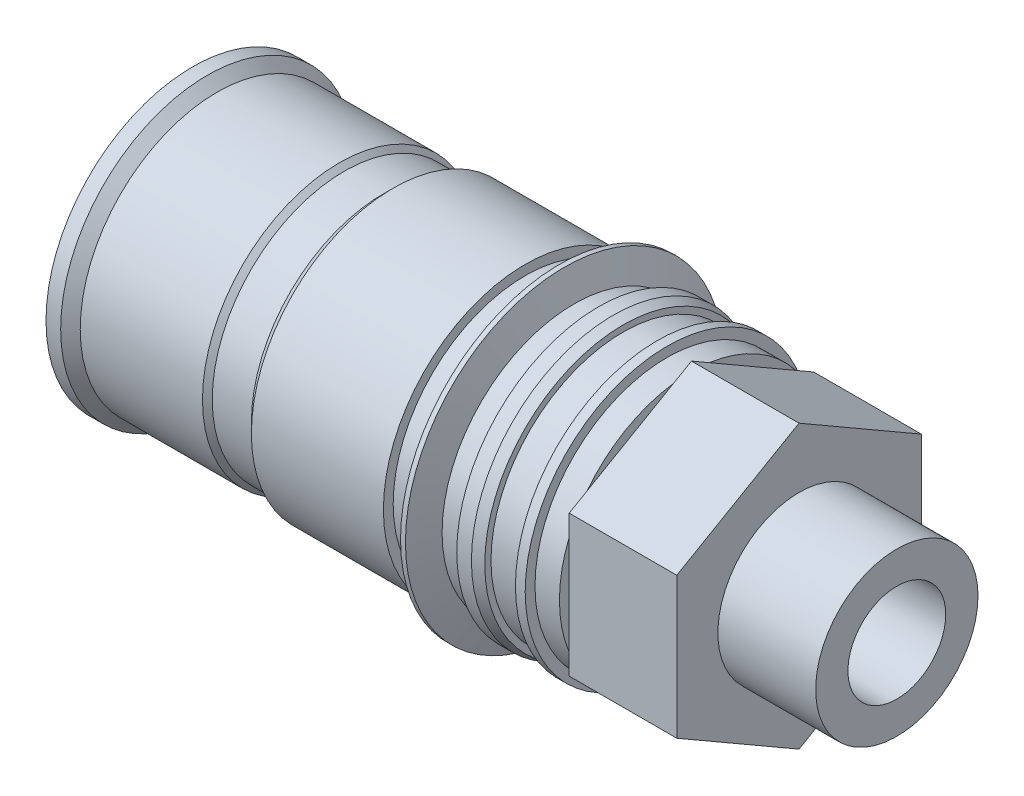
ISO-10303-21;
HEADER;
FILE_DESCRIPTION(('STEP AP214'),'2;1');
FILE_NAME('part.step','',(''),(''),'','','');
FILE_SCHEMA(('AUTOMOTIVE_DESIGN { 1 0 10303 214 1 1 1 1 }'));
ENDSEC;
DATA;
#1=APPLICATION_CONTEXT('core data for automotive mechanical design processes');
#2=APPLICATION_PROTOCOL_DEFINITION('international standard','automotive_design',2000,#1);
#3=PRODUCT_CONTEXT('',#1,'mechanical');
#4=PRODUCT('Part','Part','',(#3));
#5=PRODUCT_RELATED_PRODUCT_CATEGORY('part','',(#4));
#6=PRODUCT_DEFINITION_FORMATION('','',#4);
#7=PRODUCT_DEFINITION_CONTEXT('part definition',#1,'design');
#8=PRODUCT_DEFINITION('design','',#6,#7);
#9=PRODUCT_DEFINITION_SHAPE('','',#8);
#10=(LENGTH_UNIT() NAMED_UNIT(*) SI_UNIT(.MILLI.,.METRE.));
#11=(NAMED_UNIT(*) PLANE_ANGLE_UNIT() SI_UNIT($,.RADIAN.));
#12=(NAMED_UNIT(*) SI_UNIT($,.STERADIAN.) SOLID_ANGLE_UNIT());
#13=UNCERTAINTY_MEASURE_WITH_UNIT(LENGTH_MEASURE(1.E-05),#10,'distance_accuracy_value','');
#14=(GEOMETRIC_REPRESENTATION_CONTEXT(3) GLOBAL_UNCERTAINTY_ASSIGNED_CONTEXT((#13)) GLOBAL_UNIT_ASSIGNED_CONTEXT((#10,
#11,#12)) REPRESENTATION_CONTEXT('',''));
#15=CARTESIAN_POINT('',(0.,0.,0.));
#16=DIRECTION('',(0.,0.,1.));
#17=DIRECTION('',(1.,0.,0.));
#18=AXIS2_PLACEMENT_3D('',#15,#16,#17);
#19=CARTESIAN_POINT('',(102.,27.,0.));
#20=DIRECTION('',(-1.,0.,0.));
#21=DIRECTION('',(0.,0.,1.));
#22=AXIS2_PLACEMENT_3D('',#19,#20,#21);
#23=PLANE('',#22);
#24=DIRECTION('',(0.,0.5,0.866025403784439));
#25=VECTOR('',#24,1.);
#26=CARTESIAN_POINT('',(102.,14.4337567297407,-25.));
#27=LINE('',#26,#25);
#28=CARTESIAN_POINT('',(102.,16.5516155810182,-21.3317608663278));
#29=VERTEX_POINT('',#28);
#30=CARTESIAN_POINT('',(102.,26.7496546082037,-3.66823913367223));
#31=VERTEX_POINT('',#30);
#32=EDGE_CURVE('E42',#29,#31,#27,.T.);
#33=ORIENTED_EDGE('',*,*,#32,.F.);
#34=CARTESIAN_POINT('',(102.,0.,0.));
#35=DIRECTION('',(-1.,0.,0.));
#36=DIRECTION('',(0.,0.,1.));
#37=AXIS2_PLACEMENT_3D('',#34,#35,#36);
#38=CIRCLE('',#37,27.);
#39=EDGE_CURVE('E297',#31,#29,#38,.T.);
#40=ORIENTED_EDGE('',*,*,#39,.F.);
#41=EDGE_LOOP('',(#33,#40));
#42=FACE_BOUND('',#41,.T.);
#43=ADVANCED_FACE('F33',(#42),#23,.F.);
#44=DIRECTION('',(0.,1.,0.));
#45=VECTOR('',#44,1.);
#46=CARTESIAN_POINT('',(102.,-14.4337567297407,-25.));
#47=LINE('',#46,#45);
#48=CARTESIAN_POINT('',(102.,-10.1980390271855,-25.));
#49=VERTEX_POINT('',#48);
#50=CARTESIAN_POINT('',(102.,10.1980390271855,-25.));
#51=VERTEX_POINT('',#50);
#52=EDGE_CURVE('E243',#49,#51,#47,.T.);
#53=ORIENTED_EDGE('',*,*,#52,.F.);
#54=EDGE_CURVE('E291',#51,#49,#38,.T.);
#55=ORIENTED_EDGE('',*,*,#54,.F.);
#56=EDGE_LOOP('',(#53,#55));
#57=FACE_BOUND('',#56,.T.);
#58=ADVANCED_FACE('F324',(#57),#23,.F.);
#59=DIRECTION('',(0.,0.5,-0.866025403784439));
#60=VECTOR('',#59,1.);
#61=CARTESIAN_POINT('',(102.,-28.8675134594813,0.));
#62=LINE('',#61,#60);
#63=CARTESIAN_POINT('',(102.,-26.7496546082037,-3.66823913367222));
#64=VERTEX_POINT('',#63);
#65=CARTESIAN_POINT('',(102.,-16.5516155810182,-21.3317608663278));
#66=VERTEX_POINT('',#65);
#67=EDGE_CURVE('E245',#64,#66,#62,.T.);
#68=ORIENTED_EDGE('',*,*,#67,.F.);
#69=EDGE_CURVE('E285',#66,#64,#38,.T.);
#70=ORIENTED_EDGE('',*,*,#69,.F.);
#71=EDGE_LOOP('',(#68,#70));
#72=FACE_BOUND('',#71,.T.);
#73=ADVANCED_FACE('F331',(#72),#23,.F.);
#74=DIRECTION('',(0.,-0.5,-0.866025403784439));
#75=VECTOR('',#74,1.);
#76=CARTESIAN_POINT('',(102.,-14.4337567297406,25.));
#77=LINE('',#76,#75);
#78=CARTESIAN_POINT('',(102.,-16.5516155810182,21.3317608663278));
#79=VERTEX_POINT('',#78);
#80=CARTESIAN_POINT('',(102.,-26.7496546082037,3.66823913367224));
#81=VERTEX_POINT('',#80);
#82=EDGE_CURVE('E56',#79,#81,#77,.T.);
#83=ORIENTED_EDGE('',*,*,#82,.F.);
#84=EDGE_CURVE('E282',#81,#79,#38,.T.);
#85=ORIENTED_EDGE('',*,*,#84,.F.);
#86=EDGE_LOOP('',(#83,#85));
#87=FACE_BOUND('',#86,.T.);
#88=ADVANCED_FACE('F343',(#87),#23,.F.);
#89=DIRECTION('',(0.,-1.,0.));
#90=VECTOR('',#89,1.);
#91=CARTESIAN_POINT('',(102.,14.4337567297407,25.));
#92=LINE('',#91,#90);
#93=CARTESIAN_POINT('',(102.,10.1980390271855,25.));
#94=VERTEX_POINT('',#93);
#95=CARTESIAN_POINT('',(102.,-10.1980390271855,25.));
#96=VERTEX_POINT('',#95);
#97=EDGE_CURVE('E229',#94,#96,#92,.T.);
#98=ORIENTED_EDGE('',*,*,#97,.F.);
#99=EDGE_CURVE('E49',#96,#94,#38,.T.);
#100=ORIENTED_EDGE('',*,*,#99,.F.);
#101=EDGE_LOOP('',(#98,#100));
#102=FACE_BOUND('',#101,.T.);
#103=ADVANCED_FACE('F336',(#102),#23,.F.);
#104=DIRECTION('',(0.,-0.5,0.866025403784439));
#105=VECTOR('',#104,1.);
#106=CARTESIAN_POINT('',(102.,28.8675134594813,0.));
#107=LINE('',#106,#105);
#108=CARTESIAN_POINT('',(102.,26.7496546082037,3.66823913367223));
#109=VERTEX_POINT('',#108);
#110=CARTESIAN_POINT('',(102.,16.5516155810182,21.3317608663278));
#111=VERTEX_POINT('',#110);
#112=EDGE_CURVE('E225',#109,#111,#107,.T.);
#113=ORIENTED_EDGE('',*,*,#112,.F.);
#114=EDGE_CURVE('E161',#111,#109,#38,.T.);
#115=ORIENTED_EDGE('',*,*,#114,.F.);
#116=EDGE_LOOP('',(#113,#115));
#117=FACE_BOUND('',#116,.T.);
#118=ADVANCED_FACE('F327',(#117),#23,.F.);
#119=CARTESIAN_POINT('',(0.,0.,0.));
#120=DIRECTION('',(1.,0.,0.));
#121=DIRECTION('',(0.,0.,-1.));
#122=AXIS2_PLACEMENT_3D('',#119,#120,#121);
#123=PLANE('',#122);
#124=CARTESIAN_POINT('',(0.,0.,0.));
#125=DIRECTION('',(1.,0.,0.));
#126=DIRECTION('',(0.,0.,-1.));
#127=AXIS2_PLACEMENT_3D('',#124,#125,#126);
#128=CIRCLE('',#127,10.);
#129=CARTESIAN_POINT('',(0.,0.,-10.));
#130=VERTEX_POINT('',#129);
#131=EDGE_CURVE('E398',#130,#130,#128,.T.);
#132=ORIENTED_EDGE('',*,*,#131,.T.);
#133=EDGE_LOOP('',(#132));
#134=FACE_BOUND('',#133,.T.);
#135=CARTESIAN_POINT('',(0.,0.,0.));
#136=DIRECTION('',(-1.,0.,0.));
#137=DIRECTION('',(0.,0.,1.));
#138=AXIS2_PLACEMENT_3D('',#135,#136,#137);
#139=CIRCLE('',#138,30.);
#140=CARTESIAN_POINT('',(0.,0.,30.));
#141=VERTEX_POINT('',#140);
#142=EDGE_CURVE('E37',#141,#141,#139,.T.);
#143=ORIENTED_EDGE('',*,*,#142,.T.);
#144=EDGE_LOOP('',(#143));
#145=FACE_BOUND('',#144,.T.);
#146=ADVANCED_FACE('F35',(#134,#145),#123,.F.);
#147=CARTESIAN_POINT('',(0.,0.,0.));
#148=DIRECTION('',(-1.,0.,0.));
#149=DIRECTION('',(0.,0.,1.));
#150=AXIS2_PLACEMENT_3D('',#147,#148,#149);
#151=CYLINDRICAL_SURFACE('',#150,30.);
#152=ORIENTED_EDGE('',*,*,#142,.F.);
#153=EDGE_LOOP('',(#152));
#154=FACE_BOUND('',#153,.T.);
#155=CARTESIAN_POINT('',(3.,0.,0.));
#156=DIRECTION('',(-1.,0.,0.));
#157=DIRECTION('',(0.,0.,1.));
#158=AXIS2_PLACEMENT_3D('',#155,#156,#157);
#159=CIRCLE('',#158,30.);
#160=CARTESIAN_POINT('',(3.,0.,30.));
#161=VERTEX_POINT('',#160);
#162=EDGE_CURVE('E220',#161,#161,#159,.T.);
#163=ORIENTED_EDGE('',*,*,#162,.T.);
#164=EDGE_LOOP('',(#163));
#165=FACE_BOUND('',#164,.T.);
#166=ADVANCED_FACE('F341',(#154,#165),#151,.T.);
#167=CARTESIAN_POINT('',(5.,0.,0.));
#168=DIRECTION('',(-1.,0.,0.));
#169=DIRECTION('',(0.,0.,1.));
#170=AXIS2_PLACEMENT_3D('',#167,#168,#169);
#171=CONICAL_SURFACE('',#170,28.,0.78539816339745);
#172=ORIENTED_EDGE('',*,*,#162,.F.);
#173=EDGE_LOOP('',(#172));
#174=FACE_BOUND('',#173,.T.);
#175=CARTESIAN_POINT('',(5.,0.,0.));
#176=DIRECTION('',(-1.,0.,0.));
#177=DIRECTION('',(0.,0.,1.));
#178=AXIS2_PLACEMENT_3D('',#175,#176,#177);
#179=CIRCLE('',#178,28.);
#180=CARTESIAN_POINT('',(5.,0.,28.));
#181=VERTEX_POINT('',#180);
#182=EDGE_CURVE('E218',#181,#181,#179,.T.);
#183=ORIENTED_EDGE('',*,*,#182,.T.);
#184=EDGE_LOOP('',(#183));
#185=FACE_BOUND('',#184,.T.);
#186=ADVANCED_FACE('F440',(#174,#185),#171,.T.);
#187=CARTESIAN_POINT('',(0.,0.,0.));
#188=DIRECTION('',(-1.,0.,0.));
#189=DIRECTION('',(0.,0.,1.));
#190=AXIS2_PLACEMENT_3D('',#187,#188,#189);
#191=CYLINDRICAL_SURFACE('',#190,28.);
#192=ORIENTED_EDGE('',*,*,#182,.F.);
#193=EDGE_LOOP('',(#192));
#194=FACE_BOUND('',#193,.T.);
#195=CARTESIAN_POINT('',(30.,0.,0.));
#196=DIRECTION('',(-1.,0.,0.));
#197=DIRECTION('',(0.,0.,1.));
#198=AXIS2_PLACEMENT_3D('',#195,#196,#197);
#199=CIRCLE('',#198,28.);
#200=CARTESIAN_POINT('',(30.,0.,28.));
#201=VERTEX_POINT('',#200);
#202=EDGE_CURVE('E215',#201,#201,#199,.T.);
#203=ORIENTED_EDGE('',*,*,#202,.T.);
#204=EDGE_LOOP('',(#203));
#205=FACE_BOUND('',#204,.T.);
#206=ADVANCED_FACE('F446',(#194,#205),#191,.T.);
#207=CARTESIAN_POINT('',(31.,0.,0.));
#208=DIRECTION('',(-1.,0.,0.));
#209=DIRECTION('',(0.,0.,1.));
#210=AXIS2_PLACEMENT_3D('',#207,#208,#209);
#211=CONICAL_SURFACE('',#210,27.,0.78539816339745);
#212=ORIENTED_EDGE('',*,*,#202,.F.);
#213=EDGE_LOOP('',(#212));
#214=FACE_BOUND('',#213,.T.);
#215=CARTESIAN_POINT('',(31.,0.,0.));
#216=DIRECTION('',(-1.,0.,0.));
#217=DIRECTION('',(0.,0.,1.));
#218=AXIS2_PLACEMENT_3D('',#215,#216,#217);
#219=CIRCLE('',#218,27.);
#220=CARTESIAN_POINT('',(31.,0.,27.));
#221=VERTEX_POINT('',#220);
#222=EDGE_CURVE('E212',#221,#221,#219,.T.);
#223=ORIENTED_EDGE('',*,*,#222,.T.);
#224=EDGE_LOOP('',(#223));
#225=FACE_BOUND('',#224,.T.);
#226=ADVANCED_FACE('F454',(#214,#225),#211,.T.);
#227=CARTESIAN_POINT('',(0.,0.,0.));
#228=DIRECTION('',(-1.,0.,0.));
#229=DIRECTION('',(0.,0.,1.));
#230=AXIS2_PLACEMENT_3D('',#227,#228,#229);
#231=CYLINDRICAL_SURFACE('',#230,27.);
#232=ORIENTED_EDGE('',*,*,#222,.F.);
#233=EDGE_LOOP('',(#232));
#234=FACE_BOUND('',#233,.T.);
#235=CARTESIAN_POINT('',(39.,0.,0.));
#236=DIRECTION('',(-1.,0.,0.));
#237=DIRECTION('',(0.,0.,1.));
#238=AXIS2_PLACEMENT_3D('',#235,#236,#237);
#239=CIRCLE('',#238,27.);
#240=CARTESIAN_POINT('',(39.,0.,27.));
#241=VERTEX_POINT('',#240);
#242=EDGE_CURVE('E209',#241,#241,#239,.T.);
#243=ORIENTED_EDGE('',*,*,#242,.T.);
#244=EDGE_LOOP('',(#243));
#245=FACE_BOUND('',#244,.T.);
#246=ADVANCED_FACE('F462',(#234,#245),#231,.T.);
#247=CARTESIAN_POINT('',(41.,0.,0.));
#248=DIRECTION('',(1.,0.,0.));
#249=DIRECTION('',(0.,0.,-1.));
#250=AXIS2_PLACEMENT_3D('',#247,#248,#249);
#251=CONICAL_SURFACE('',#250,29.,0.785398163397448);
#252=ORIENTED_EDGE('',*,*,#242,.F.);
#253=EDGE_LOOP('',(#252));
#254=FACE_BOUND('',#253,.T.);
#255=CARTESIAN_POINT('',(41.,0.,0.));
#256=DIRECTION('',(-1.,0.,0.));
#257=DIRECTION('',(0.,0.,1.));
#258=AXIS2_PLACEMENT_3D('',#255,#256,#257);
#259=CIRCLE('',#258,29.);
#260=CARTESIAN_POINT('',(41.,0.,29.));
#261=VERTEX_POINT('',#260);
#262=EDGE_CURVE('E206',#261,#261,#259,.T.);
#263=ORIENTED_EDGE('',*,*,#262,.T.);
#264=EDGE_LOOP('',(#263));
#265=FACE_BOUND('',#264,.T.);
#266=ADVANCED_FACE('F470',(#254,#265),#251,.T.);
#267=CARTESIAN_POINT('',(0.,0.,0.));
#268=DIRECTION('',(-1.,0.,0.));
#269=DIRECTION('',(0.,0.,1.));
#270=AXIS2_PLACEMENT_3D('',#267,#268,#269);
#271=CYLINDRICAL_SURFACE('',#270,29.);
#272=ORIENTED_EDGE('',*,*,#262,.F.);
#273=EDGE_LOOP('',(#272));
#274=FACE_BOUND('',#273,.T.);
#275=CARTESIAN_POINT('',(68.,0.,0.));
#276=DIRECTION('',(-1.,0.,0.));
#277=DIRECTION('',(0.,0.,1.));
#278=AXIS2_PLACEMENT_3D('',#275,#276,#277);
#279=CIRCLE('',#278,29.);
#280=CARTESIAN_POINT('',(68.,0.,29.));
#281=VERTEX_POINT('',#280);
#282=EDGE_CURVE('E203',#281,#281,#279,.T.);
#283=ORIENTED_EDGE('',*,*,#282,.T.);
#284=EDGE_LOOP('',(#283));
#285=FACE_BOUND('',#284,.T.);
#286=ADVANCED_FACE('F478',(#274,#285),#271,.T.);
#287=CARTESIAN_POINT('',(68.,29.,0.));
#288=DIRECTION('',(-1.,0.,0.));
#289=DIRECTION('',(0.,0.,1.));
#290=AXIS2_PLACEMENT_3D('',#287,#288,#289);
#291=PLANE('',#290);
#292=ORIENTED_EDGE('',*,*,#282,.F.);
#293=EDGE_LOOP('',(#292));
#294=FACE_BOUND('',#293,.T.);
#295=CARTESIAN_POINT('',(68.,0.,0.));
#296=DIRECTION('',(-1.,0.,0.));
#297=DIRECTION('',(0.,0.,1.));
#298=AXIS2_PLACEMENT_3D('',#295,#296,#297);
#299=CIRCLE('',#298,27.);
#300=CARTESIAN_POINT('',(68.,0.,27.));
#301=VERTEX_POINT('',#300);
#302=EDGE_CURVE('E200',#301,#301,#299,.T.);
#303=ORIENTED_EDGE('',*,*,#302,.T.);
#304=EDGE_LOOP('',(#303));
#305=FACE_BOUND('',#304,.T.);
#306=ADVANCED_FACE('F486',(#294,#305),#291,.F.);
#307=CARTESIAN_POINT('',(0.,0.,0.));
#308=DIRECTION('',(-1.,0.,0.));
#309=DIRECTION('',(0.,0.,1.));
#310=AXIS2_PLACEMENT_3D('',#307,#308,#309);
#311=CYLINDRICAL_SURFACE('',#310,27.);
#312=ORIENTED_EDGE('',*,*,#302,.F.);
#313=EDGE_LOOP('',(#312));
#314=FACE_BOUND('',#313,.T.);
#315=CARTESIAN_POINT('',(73.,0.,0.));
#316=DIRECTION('',(-1.,0.,0.));
#317=DIRECTION('',(0.,0.,1.));
#318=AXIS2_PLACEMENT_3D('',#315,#316,#317);
#319=CIRCLE('',#318,27.);
#320=CARTESIAN_POINT('',(73.,0.,27.));
#321=VERTEX_POINT('',#320);
#322=EDGE_CURVE('E197',#321,#321,#319,.T.);
#323=ORIENTED_EDGE('',*,*,#322,.T.);
#324=EDGE_LOOP('',(#323));
#325=FACE_BOUND('',#324,.T.);
#326=ADVANCED_FACE('F494',(#314,#325),#311,.T.);
#327=CARTESIAN_POINT('',(75.,0.,0.));
#328=DIRECTION('',(1.,0.,0.));
#329=DIRECTION('',(0.,0.,-1.));
#330=AXIS2_PLACEMENT_3D('',#327,#328,#329);
#331=CONICAL_SURFACE('',#330,32.4949548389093,1.22173047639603);
#332=ORIENTED_EDGE('',*,*,#322,.F.);
#333=EDGE_LOOP('',(#332));
#334=FACE_BOUND('',#333,.T.);
#335=CARTESIAN_POINT('',(75.,0.,0.));
#336=DIRECTION('',(-1.,0.,0.));
#337=DIRECTION('',(0.,0.,1.));
#338=AXIS2_PLACEMENT_3D('',#335,#336,#337);
#339=CIRCLE('',#338,32.4949548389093);
#340=CARTESIAN_POINT('',(75.,0.,32.4949548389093));
#341=VERTEX_POINT('',#340);
#342=EDGE_CURVE('E194',#341,#341,#339,.T.);
#343=ORIENTED_EDGE('',*,*,#342,.T.);
#344=EDGE_LOOP('',(#343));
#345=FACE_BOUND('',#344,.T.);
#346=ADVANCED_FACE('F502',(#334,#345),#331,.T.);
#347=CARTESIAN_POINT('',(0.,0.,0.));
#348=DIRECTION('',(-1.,0.,0.));
#349=DIRECTION('',(0.,0.,1.));
#350=AXIS2_PLACEMENT_3D('',#347,#348,#349);
#351=CYLINDRICAL_SURFACE('',#350,32.4949548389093);
#352=ORIENTED_EDGE('',*,*,#342,.F.);
#353=EDGE_LOOP('',(#352));
#354=FACE_BOUND('',#353,.T.);
#355=CARTESIAN_POINT('',(76.,0.,0.));
#356=DIRECTION('',(-1.,0.,0.));
#357=DIRECTION('',(0.,0.,1.));
#358=AXIS2_PLACEMENT_3D('',#355,#356,#357);
#359=CIRCLE('',#358,32.4949548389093);
#360=CARTESIAN_POINT('',(76.,0.,32.4949548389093));
#361=VERTEX_POINT('',#360);
#362=EDGE_CURVE('E191',#361,#361,#359,.T.);
#363=ORIENTED_EDGE('',*,*,#362,.T.);
#364=EDGE_LOOP('',(#363));
#365=FACE_BOUND('',#364,.T.);
#366=ADVANCED_FACE('F510',(#354,#365),#351,.T.);
#367=CARTESIAN_POINT('',(78.,0.,0.));
#368=DIRECTION('',(-1.,0.,0.));
#369=DIRECTION('',(0.,0.,1.));
#370=AXIS2_PLACEMENT_3D('',#367,#368,#369);
#371=CONICAL_SURFACE('',#370,27.,1.22173047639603);
#372=ORIENTED_EDGE('',*,*,#362,.F.);
#373=EDGE_LOOP('',(#372));
#374=FACE_BOUND('',#373,.T.);
#375=CARTESIAN_POINT('',(78.,0.,0.));
#376=DIRECTION('',(-1.,0.,0.));
#377=DIRECTION('',(0.,0.,1.));
#378=AXIS2_PLACEMENT_3D('',#375,#376,#377);
#379=CIRCLE('',#378,27.);
#380=CARTESIAN_POINT('',(78.,0.,27.));
#381=VERTEX_POINT('',#380);
#382=EDGE_CURVE('E188',#381,#381,#379,.T.);
#383=ORIENTED_EDGE('',*,*,#382,.T.);
#384=EDGE_LOOP('',(#383));
#385=FACE_BOUND('',#384,.T.);
#386=ADVANCED_FACE('F518',(#374,#385),#371,.T.);
#387=CARTESIAN_POINT('',(0.,0.,0.));
#388=DIRECTION('',(-1.,0.,0.));
#389=DIRECTION('',(0.,0.,1.));
#390=AXIS2_PLACEMENT_3D('',#387,#388,#389);
#391=CYLINDRICAL_SURFACE('',#390,27.);
#392=ORIENTED_EDGE('',*,*,#382,.F.);
#393=EDGE_LOOP('',(#392));
#394=FACE_BOUND('',#393,.T.);
#395=CARTESIAN_POINT('',(83.,0.,0.));
#396=DIRECTION('',(-1.,0.,0.));
#397=DIRECTION('',(0.,0.,1.));
#398=AXIS2_PLACEMENT_3D('',#395,#396,#397);
#399=CIRCLE('',#398,27.);
#400=CARTESIAN_POINT('',(83.,0.,27.));
#401=VERTEX_POINT('',#400);
#402=EDGE_CURVE('E185',#401,#401,#399,.T.);
#403=ORIENTED_EDGE('',*,*,#402,.T.);
#404=EDGE_LOOP('',(#403));
#405=FACE_BOUND('',#404,.T.);
#406=ADVANCED_FACE('F526',(#394,#405),#391,.T.);
#407=CARTESIAN_POINT('',(83.,27.,0.));
#408=DIRECTION('',(1.,0.,0.));
#409=DIRECTION('',(0.,0.,-1.));
#410=AXIS2_PLACEMENT_3D('',#407,#408,#409);
#411=PLANE('',#410);
#412=ORIENTED_EDGE('',*,*,#402,.F.);
#413=EDGE_LOOP('',(#412));
#414=FACE_BOUND('',#413,.T.);
#415=CARTESIAN_POINT('',(83.,0.,0.));
#416=DIRECTION('',(-1.,0.,0.));
#417=DIRECTION('',(0.,0.,1.));
#418=AXIS2_PLACEMENT_3D('',#415,#416,#417);
#419=CIRCLE('',#418,29.);
#420=CARTESIAN_POINT('',(83.,0.,29.));
#421=VERTEX_POINT('',#420);
#422=EDGE_CURVE('E182',#421,#421,#419,.T.);
#423=ORIENTED_EDGE('',*,*,#422,.T.);
#424=EDGE_LOOP('',(#423));
#425=FACE_BOUND('',#424,.T.);
#426=ADVANCED_FACE('F534',(#414,#425),#411,.F.);
#427=CARTESIAN_POINT('',(0.,0.,0.));
#428=DIRECTION('',(-1.,0.,0.));
#429=DIRECTION('',(0.,0.,1.));
#430=AXIS2_PLACEMENT_3D('',#427,#428,#429);
#431=CYLINDRICAL_SURFACE('',#430,29.);
#432=ORIENTED_EDGE('',*,*,#422,.F.);
#433=EDGE_LOOP('',(#432));
#434=FACE_BOUND('',#433,.T.);
#435=CARTESIAN_POINT('',(86.,0.,0.));
#436=DIRECTION('',(-1.,0.,0.));
#437=DIRECTION('',(0.,0.,1.));
#438=AXIS2_PLACEMENT_3D('',#435,#436,#437);
#439=CIRCLE('',#438,29.);
#440=CARTESIAN_POINT('',(86.,0.,29.));
#441=VERTEX_POINT('',#440);
#442=EDGE_CURVE('E179',#441,#441,#439,.T.);
#443=ORIENTED_EDGE('',*,*,#442,.T.);
#444=EDGE_LOOP('',(#443));
#445=FACE_BOUND('',#444,.T.);
#446=ADVANCED_FACE('F542',(#434,#445),#431,.T.);
#447=CARTESIAN_POINT('',(88.,0.,0.));
#448=DIRECTION('',(-1.,0.,0.));
#449=DIRECTION('',(0.,0.,1.));
#450=AXIS2_PLACEMENT_3D('',#447,#448,#449);
#451=CONICAL_SURFACE('',#450,28.2720595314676,0.349065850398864);
#452=ORIENTED_EDGE('',*,*,#442,.F.);
#453=EDGE_LOOP('',(#452));
#454=FACE_BOUND('',#453,.T.);
#455=CARTESIAN_POINT('',(88.,0.,0.));
#456=DIRECTION('',(-1.,0.,0.));
#457=DIRECTION('',(0.,0.,1.));
#458=AXIS2_PLACEMENT_3D('',#455,#456,#457);
#459=CIRCLE('',#458,28.2720595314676);
#460=CARTESIAN_POINT('',(88.,0.,28.2720595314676));
#461=VERTEX_POINT('',#460);
#462=EDGE_CURVE('E176',#461,#461,#459,.T.);
#463=ORIENTED_EDGE('',*,*,#462,.T.);
#464=EDGE_LOOP('',(#463));
#465=FACE_BOUND('',#464,.T.);
#466=ADVANCED_FACE('F550',(#454,#465),#451,.T.);
#467=CARTESIAN_POINT('',(88.0000000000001,28.2720595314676,0.));
#468=DIRECTION('',(-1.,0.,0.));
#469=DIRECTION('',(0.,0.,1.));
#470=AXIS2_PLACEMENT_3D('',#467,#468,#469);
#471=PLANE('',#470);
#472=ORIENTED_EDGE('',*,*,#462,.F.);
#473=EDGE_LOOP('',(#472));
#474=FACE_BOUND('',#473,.T.);
#475=CARTESIAN_POINT('',(88.0000000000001,0.,0.));
#476=DIRECTION('',(-1.,0.,0.));
#477=DIRECTION('',(0.,0.,1.));
#478=AXIS2_PLACEMENT_3D('',#475,#476,#477);
#479=CIRCLE('',#478,27.);
#480=CARTESIAN_POINT('',(88.0000000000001,0.,27.));
#481=VERTEX_POINT('',#480);
#482=EDGE_CURVE('E173',#481,#481,#479,.T.);
#483=ORIENTED_EDGE('',*,*,#482,.T.);
#484=EDGE_LOOP('',(#483));
#485=FACE_BOUND('',#484,.T.);
#486=ADVANCED_FACE('F558',(#474,#485),#471,.F.);
#487=CARTESIAN_POINT('',(0.,0.,0.));
#488=DIRECTION('',(-1.,0.,0.));
#489=DIRECTION('',(0.,0.,1.));
#490=AXIS2_PLACEMENT_3D('',#487,#488,#489);
#491=CYLINDRICAL_SURFACE('',#490,27.);
#492=ORIENTED_EDGE('',*,*,#482,.F.);
#493=EDGE_LOOP('',(#492));
#494=FACE_BOUND('',#493,.T.);
#495=CARTESIAN_POINT('',(95.,0.,0.));
#496=DIRECTION('',(-1.,0.,0.));
#497=DIRECTION('',(0.,0.,1.));
#498=AXIS2_PLACEMENT_3D('',#495,#496,#497);
#499=CIRCLE('',#498,27.);
#500=CARTESIAN_POINT('',(95.,0.,27.));
#501=VERTEX_POINT('',#500);
#502=EDGE_CURVE('E170',#501,#501,#499,.T.);
#503=ORIENTED_EDGE('',*,*,#502,.T.);
#504=EDGE_LOOP('',(#503));
#505=FACE_BOUND('',#504,.T.);
#506=ADVANCED_FACE('F566',(#494,#505),#491,.T.);
#507=CARTESIAN_POINT('',(95.,27.,0.));
#508=DIRECTION('',(1.,0.,0.));
#509=DIRECTION('',(0.,0.,-1.));
#510=AXIS2_PLACEMENT_3D('',#507,#508,#509);
#511=PLANE('',#510);
#512=ORIENTED_EDGE('',*,*,#502,.F.);
#513=EDGE_LOOP('',(#512));
#514=FACE_BOUND('',#513,.T.);
#515=CARTESIAN_POINT('',(95.,0.,0.));
#516=DIRECTION('',(-1.,0.,0.));
#517=DIRECTION('',(0.,0.,1.));
#518=AXIS2_PLACEMENT_3D('',#515,#516,#517);
#519=CIRCLE('',#518,29.);
#520=CARTESIAN_POINT('',(95.,0.,29.));
#521=VERTEX_POINT('',#520);
#522=EDGE_CURVE('E167',#521,#521,#519,.T.);
#523=ORIENTED_EDGE('',*,*,#522,.T.);
#524=EDGE_LOOP('',(#523));
#525=FACE_BOUND('',#524,.T.);
#526=ADVANCED_FACE('F574',(#514,#525),#511,.F.);
#527=CARTESIAN_POINT('',(0.,0.,0.));
#528=DIRECTION('',(-1.,0.,0.));
#529=DIRECTION('',(0.,0.,1.));
#530=AXIS2_PLACEMENT_3D('',#527,#528,#529);
#531=CYLINDRICAL_SURFACE('',#530,29.);
#532=ORIENTED_EDGE('',*,*,#522,.F.);
#533=EDGE_LOOP('',(#532));
#534=FACE_BOUND('',#533,.T.);
#535=CARTESIAN_POINT('',(97.,0.,0.));
#536=DIRECTION('',(-1.,0.,0.));
#537=DIRECTION('',(0.,0.,1.));
#538=AXIS2_PLACEMENT_3D('',#535,#536,#537);
#539=CIRCLE('',#538,29.);
#540=CARTESIAN_POINT('',(97.,0.,29.));
#541=VERTEX_POINT('',#540);
#542=EDGE_CURVE('E164',#541,#541,#539,.T.);
#543=ORIENTED_EDGE('',*,*,#542,.T.);
#544=EDGE_LOOP('',(#543));
#545=FACE_BOUND('',#544,.T.);
#546=ADVANCED_FACE('F582',(#534,#545),#531,.T.);
#547=CARTESIAN_POINT('',(97.,29.,0.));
#548=DIRECTION('',(-1.,0.,0.));
#549=DIRECTION('',(0.,0.,1.));
#550=AXIS2_PLACEMENT_3D('',#547,#548,#549);
#551=PLANE('',#550);
#552=ORIENTED_EDGE('',*,*,#542,.F.);
#553=EDGE_LOOP('',(#552));
#554=FACE_BOUND('',#553,.T.);
#555=CARTESIAN_POINT('',(97.,0.,0.));
#556=DIRECTION('',(-1.,0.,0.));
#557=DIRECTION('',(0.,0.,1.));
#558=AXIS2_PLACEMENT_3D('',#555,#556,#557);
#559=CIRCLE('',#558,27.);
#560=CARTESIAN_POINT('',(97.,0.,27.));
#561=VERTEX_POINT('',#560);
#562=EDGE_CURVE('E160',#561,#561,#559,.T.);
#563=ORIENTED_EDGE('',*,*,#562,.T.);
#564=EDGE_LOOP('',(#563));
#565=FACE_BOUND('',#564,.T.);
#566=ADVANCED_FACE('F590',(#554,#565),#551,.F.);
#567=CARTESIAN_POINT('',(0.,0.,0.));
#568=DIRECTION('',(-1.,0.,0.));
#569=DIRECTION('',(0.,0.,1.));
#570=AXIS2_PLACEMENT_3D('',#567,#568,#569);
#571=CYLINDRICAL_SURFACE('',#570,27.);
#572=ORIENTED_EDGE('',*,*,#562,.F.);
#573=EDGE_LOOP('',(#572));
#574=FACE_BOUND('',#573,.T.);
#575=EDGE_CURVE('E155',#94,#111,#38,.T.);
#576=ORIENTED_EDGE('',*,*,#575,.T.);
#577=ORIENTED_EDGE('',*,*,#114,.T.);
#578=EDGE_CURVE('E300',#109,#31,#38,.T.);
#579=ORIENTED_EDGE('',*,*,#578,.T.);
#580=ORIENTED_EDGE('',*,*,#39,.T.);
#581=EDGE_CURVE('E295',#29,#51,#38,.T.);
#582=ORIENTED_EDGE('',*,*,#581,.T.);
#583=ORIENTED_EDGE('',*,*,#54,.T.);
#584=EDGE_CURVE('E289',#49,#66,#38,.T.);
#585=ORIENTED_EDGE('',*,*,#584,.T.);
#586=ORIENTED_EDGE('',*,*,#69,.T.);
#587=EDGE_CURVE('E283',#64,#81,#38,.T.);
#588=ORIENTED_EDGE('',*,*,#587,.T.);
#589=ORIENTED_EDGE('',*,*,#84,.T.);
#590=EDGE_CURVE('E153',#79,#96,#38,.T.);
#591=ORIENTED_EDGE('',*,*,#590,.T.);
#592=ORIENTED_EDGE('',*,*,#99,.T.);
#593=EDGE_LOOP('',(#576,#577,#579,#580,#582,#583,#585,#586,#588,#589,#591,#592));
#594=FACE_BOUND('',#593,.T.);
#595=ADVANCED_FACE('F305',(#574,#594),#571,.T.);
#596=CARTESIAN_POINT('',(102.,0.,0.));
#597=DIRECTION('',(1.,0.,0.));
#598=DIRECTION('',(0.,0.,-1.));
#599=AXIS2_PLACEMENT_3D('',#596,#597,#598);
#600=PLANE('',#599);
#601=ORIENTED_EDGE('',*,*,#575,.F.);
#602=CARTESIAN_POINT('',(102.,14.4337567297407,25.));
#603=VERTEX_POINT('',#602);
#604=EDGE_CURVE('E235',#603,#94,#92,.T.);
#605=ORIENTED_EDGE('',*,*,#604,.F.);
#606=EDGE_CURVE('E232',#111,#603,#107,.T.);
#607=ORIENTED_EDGE('',*,*,#606,.F.);
#608=EDGE_LOOP('',(#601,#605,#607));
#609=FACE_BOUND('',#608,.T.);
#610=ADVANCED_FACE('F312',(#609),#600,.F.);
#611=ORIENTED_EDGE('',*,*,#578,.F.);
#612=CARTESIAN_POINT('',(102.,28.8675134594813,0.));
#613=VERTEX_POINT('',#612);
#614=EDGE_CURVE('E231',#613,#109,#107,.T.);
#615=ORIENTED_EDGE('',*,*,#614,.F.);
#616=EDGE_CURVE('E150',#31,#613,#27,.T.);
#617=ORIENTED_EDGE('',*,*,#616,.F.);
#618=EDGE_LOOP('',(#611,#615,#617));
#619=FACE_BOUND('',#618,.T.);
#620=ADVANCED_FACE('F309',(#619),#600,.F.);
#621=ORIENTED_EDGE('',*,*,#581,.F.);
#622=CARTESIAN_POINT('',(102.,14.4337567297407,-25.));
#623=VERTEX_POINT('',#622);
#624=EDGE_CURVE('E238',#623,#29,#27,.T.);
#625=ORIENTED_EDGE('',*,*,#624,.F.);
#626=EDGE_CURVE('E247',#51,#623,#47,.T.);
#627=ORIENTED_EDGE('',*,*,#626,.F.);
#628=EDGE_LOOP('',(#621,#625,#627));
#629=FACE_BOUND('',#628,.T.);
#630=ADVANCED_FACE('F311',(#629),#600,.F.);
#631=ORIENTED_EDGE('',*,*,#584,.F.);
#632=CARTESIAN_POINT('',(102.,-14.4337567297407,-25.));
#633=VERTEX_POINT('',#632);
#634=EDGE_CURVE('E144',#633,#49,#47,.T.);
#635=ORIENTED_EDGE('',*,*,#634,.F.);
#636=EDGE_CURVE('E253',#66,#633,#62,.T.);
#637=ORIENTED_EDGE('',*,*,#636,.F.);
#638=EDGE_LOOP('',(#631,#635,#637));
#639=FACE_BOUND('',#638,.T.);
#640=ADVANCED_FACE('F318',(#639),#600,.F.);
#641=ORIENTED_EDGE('',*,*,#587,.F.);
#642=CARTESIAN_POINT('',(102.,-28.8675134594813,0.));
#643=VERTEX_POINT('',#642);
#644=EDGE_CURVE('E252',#643,#64,#62,.T.);
#645=ORIENTED_EDGE('',*,*,#644,.F.);
#646=EDGE_CURVE('E263',#81,#643,#77,.T.);
#647=ORIENTED_EDGE('',*,*,#646,.F.);
#648=EDGE_LOOP('',(#641,#645,#647));
#649=FACE_BOUND('',#648,.T.);
#650=ADVANCED_FACE('F364',(#649),#600,.F.);
#651=CARTESIAN_POINT('',(124.,14.4337567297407,-25.));
#652=DIRECTION('',(0.,-0.866025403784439,0.5));
#653=DIRECTION('',(0.,-0.5,-0.866025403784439));
#654=AXIS2_PLACEMENT_3D('',#651,#652,#653);
#655=PLANE('',#654);
#656=ORIENTED_EDGE('',*,*,#624,.T.);
#657=ORIENTED_EDGE('',*,*,#32,.T.);
#658=ORIENTED_EDGE('',*,*,#616,.T.);
#659=DIRECTION('',(-1.,0.,0.));
#660=VECTOR('',#659,1.);
#661=CARTESIAN_POINT('',(124.,28.8675134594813,0.));
#662=LINE('',#661,#660);
#663=CARTESIAN_POINT('',(124.,28.8675134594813,0.));
#664=VERTEX_POINT('',#663);
#665=EDGE_CURVE('E129',#664,#613,#662,.T.);
#666=ORIENTED_EDGE('',*,*,#665,.F.);
#667=DIRECTION('',(0.,0.5,0.866025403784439));
#668=VECTOR('',#667,1.);
#669=CARTESIAN_POINT('',(124.,14.4337567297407,-25.));
#670=LINE('',#669,#668);
#671=CARTESIAN_POINT('',(124.,14.4337567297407,-25.));
#672=VERTEX_POINT('',#671);
#673=EDGE_CURVE('E135',#672,#664,#670,.T.);
#674=ORIENTED_EDGE('',*,*,#673,.F.);
#675=DIRECTION('',(-1.,0.,0.));
#676=VECTOR('',#675,1.);
#677=CARTESIAN_POINT('',(124.,14.4337567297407,-25.));
#678=LINE('',#677,#676);
#679=EDGE_CURVE('E361',#672,#623,#678,.T.);
#680=ORIENTED_EDGE('',*,*,#679,.T.);
#681=EDGE_LOOP('',(#656,#657,#658,#666,#674,#680));
#682=FACE_BOUND('',#681,.T.);
#683=ADVANCED_FACE('F147',(#682),#655,.F.);
#684=CARTESIAN_POINT('',(124.,28.8675134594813,0.));
#685=DIRECTION('',(0.,-0.866025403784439,-0.5));
#686=DIRECTION('',(0.,0.5,-0.866025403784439));
#687=AXIS2_PLACEMENT_3D('',#684,#685,#686);
#688=PLANE('',#687);
#689=ORIENTED_EDGE('',*,*,#614,.T.);
#690=ORIENTED_EDGE('',*,*,#112,.T.);
#691=ORIENTED_EDGE('',*,*,#606,.T.);
#692=DIRECTION('',(-1.,0.,0.));
#693=VECTOR('',#692,1.);
#694=CARTESIAN_POINT('',(124.,14.4337567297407,25.));
#695=LINE('',#694,#693);
#696=CARTESIAN_POINT('',(124.,14.4337567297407,25.));
#697=VERTEX_POINT('',#696);
#698=EDGE_CURVE('E131',#697,#603,#695,.T.);
#699=ORIENTED_EDGE('',*,*,#698,.F.);
#700=DIRECTION('',(0.,-0.5,0.866025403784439));
#701=VECTOR('',#700,1.);
#702=CARTESIAN_POINT('',(124.,28.8675134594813,0.));
#703=LINE('',#702,#701);
#704=EDGE_CURVE('E124',#664,#697,#703,.T.);
#705=ORIENTED_EDGE('',*,*,#704,.F.);
#706=ORIENTED_EDGE('',*,*,#665,.T.);
#707=EDGE_LOOP('',(#689,#690,#691,#699,#705,#706));
#708=FACE_BOUND('',#707,.T.);
#709=ADVANCED_FACE('F127',(#708),#688,.F.);
#710=CARTESIAN_POINT('',(124.,14.4337567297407,25.));
#711=DIRECTION('',(0.,0.,-1.));
#712=DIRECTION('',(-1.,0.,0.));
#713=AXIS2_PLACEMENT_3D('',#710,#711,#712);
#714=PLANE('',#713);
#715=ORIENTED_EDGE('',*,*,#604,.T.);
#716=ORIENTED_EDGE('',*,*,#97,.T.);
#717=CARTESIAN_POINT('',(102.,-14.4337567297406,25.));
#718=VERTEX_POINT('',#717);
#719=EDGE_CURVE('E236',#96,#718,#92,.T.);
#720=ORIENTED_EDGE('',*,*,#719,.T.);
#721=DIRECTION('',(-1.,0.,0.));
#722=VECTOR('',#721,1.);
#723=CARTESIAN_POINT('',(124.,-14.4337567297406,25.));
#724=LINE('',#723,#722);
#725=CARTESIAN_POINT('',(124.,-14.4337567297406,25.));
#726=VERTEX_POINT('',#725);
#727=EDGE_CURVE('E156',#726,#718,#724,.T.);
#728=ORIENTED_EDGE('',*,*,#727,.F.);
#729=DIRECTION('',(0.,-1.,0.));
#730=VECTOR('',#729,1.);
#731=CARTESIAN_POINT('',(124.,14.4337567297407,25.));
#732=LINE('',#731,#730);
#733=EDGE_CURVE('E134',#697,#726,#732,.T.);
#734=ORIENTED_EDGE('',*,*,#733,.F.);
#735=ORIENTED_EDGE('',*,*,#698,.T.);
#736=EDGE_LOOP('',(#715,#716,#720,#728,#734,#735));
#737=FACE_BOUND('',#736,.T.);
#738=ADVANCED_FACE('F270',(#737),#714,.F.);
#739=CARTESIAN_POINT('',(124.,-14.4337567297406,25.));
#740=DIRECTION('',(0.,0.866025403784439,-0.5));
#741=DIRECTION('',(0.,0.5,0.866025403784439));
#742=AXIS2_PLACEMENT_3D('',#739,#740,#741);
#743=PLANE('',#742);
#744=EDGE_CURVE('E260',#718,#79,#77,.T.);
#745=ORIENTED_EDGE('',*,*,#744,.T.);
#746=ORIENTED_EDGE('',*,*,#82,.T.);
#747=ORIENTED_EDGE('',*,*,#646,.T.);
#748=DIRECTION('',(-1.,0.,0.));
#749=VECTOR('',#748,1.);
#750=CARTESIAN_POINT('',(124.,-28.8675134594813,0.));
#751=LINE('',#750,#749);
#752=CARTESIAN_POINT('',(124.,-28.8675134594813,0.));
#753=VERTEX_POINT('',#752);
#754=EDGE_CURVE('E279',#753,#643,#751,.T.);
#755=ORIENTED_EDGE('',*,*,#754,.F.);
#756=DIRECTION('',(0.,-0.5,-0.866025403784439));
#757=VECTOR('',#756,1.);
#758=CARTESIAN_POINT('',(124.,-14.4337567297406,25.));
#759=LINE('',#758,#757);
#760=EDGE_CURVE('E278',#726,#753,#759,.T.);
#761=ORIENTED_EDGE('',*,*,#760,.F.);
#762=ORIENTED_EDGE('',*,*,#727,.T.);
#763=EDGE_LOOP('',(#745,#746,#747,#755,#761,#762));
#764=FACE_BOUND('',#763,.T.);
#765=ADVANCED_FACE('F276',(#764),#743,.F.);
#766=CARTESIAN_POINT('',(124.,-28.8675134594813,0.));
#767=DIRECTION('',(0.,0.866025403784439,0.5));
#768=DIRECTION('',(0.,-0.5,0.866025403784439));
#769=AXIS2_PLACEMENT_3D('',#766,#767,#768);
#770=PLANE('',#769);
#771=ORIENTED_EDGE('',*,*,#644,.T.);
#772=ORIENTED_EDGE('',*,*,#67,.T.);
#773=ORIENTED_EDGE('',*,*,#636,.T.);
#774=DIRECTION('',(-1.,0.,0.));
#775=VECTOR('',#774,1.);
#776=CARTESIAN_POINT('',(124.,-14.4337567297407,-25.));
#777=LINE('',#776,#775);
#778=CARTESIAN_POINT('',(124.,-14.4337567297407,-25.));
#779=VERTEX_POINT('',#778);
#780=EDGE_CURVE('E357',#779,#633,#777,.T.);
#781=ORIENTED_EDGE('',*,*,#780,.F.);
#782=DIRECTION('',(0.,0.5,-0.866025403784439));
#783=VECTOR('',#782,1.);
#784=CARTESIAN_POINT('',(124.,-28.8675134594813,0.));
#785=LINE('',#784,#783);
#786=EDGE_CURVE('E409',#753,#779,#785,.T.);
#787=ORIENTED_EDGE('',*,*,#786,.F.);
#788=ORIENTED_EDGE('',*,*,#754,.T.);
#789=EDGE_LOOP('',(#771,#772,#773,#781,#787,#788));
#790=FACE_BOUND('',#789,.T.);
#791=ADVANCED_FACE('F353',(#790),#770,.F.);
#792=CARTESIAN_POINT('',(124.,-14.4337567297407,-25.));
#793=DIRECTION('',(0.,0.,1.));
#794=DIRECTION('',(0.,-1.,0.));
#795=AXIS2_PLACEMENT_3D('',#792,#793,#794);
#796=PLANE('',#795);
#797=ORIENTED_EDGE('',*,*,#634,.T.);
#798=ORIENTED_EDGE('',*,*,#52,.T.);
#799=ORIENTED_EDGE('',*,*,#626,.T.);
#800=ORIENTED_EDGE('',*,*,#679,.F.);
#801=DIRECTION('',(0.,1.,0.));
#802=VECTOR('',#801,1.);
#803=CARTESIAN_POINT('',(124.,-14.4337567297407,-25.));
#804=LINE('',#803,#802);
#805=EDGE_CURVE('E140',#779,#672,#804,.T.);
#806=ORIENTED_EDGE('',*,*,#805,.F.);
#807=ORIENTED_EDGE('',*,*,#780,.T.);
#808=EDGE_LOOP('',(#797,#798,#799,#800,#806,#807));
#809=FACE_BOUND('',#808,.T.);
#810=ADVANCED_FACE('F360',(#809),#796,.F.);
#811=CARTESIAN_POINT('',(124.,0.,0.));
#812=DIRECTION('',(1.,0.,0.));
#813=DIRECTION('',(0.,0.,-1.));
#814=AXIS2_PLACEMENT_3D('',#811,#812,#813);
#815=PLANE('',#814);
#816=CARTESIAN_POINT('',(124.,0.,0.));
#817=DIRECTION('',(1.,0.,0.));
#818=DIRECTION('',(0.,0.,-1.));
#819=AXIS2_PLACEMENT_3D('',#816,#817,#818);
#820=CIRCLE('',#819,16.6);
#821=CARTESIAN_POINT('',(124.,0.,-16.6));
#822=VERTEX_POINT('',#821);
#823=EDGE_CURVE('E11',#822,#822,#820,.T.);
#824=ORIENTED_EDGE('',*,*,#823,.F.);
#825=EDGE_LOOP('',(#824));
#826=FACE_BOUND('',#825,.T.);
#827=ORIENTED_EDGE('',*,*,#673,.T.);
#828=ORIENTED_EDGE('',*,*,#704,.T.);
#829=ORIENTED_EDGE('',*,*,#733,.T.);
#830=ORIENTED_EDGE('',*,*,#760,.T.);
#831=ORIENTED_EDGE('',*,*,#786,.T.);
#832=ORIENTED_EDGE('',*,*,#805,.T.);
#833=EDGE_LOOP('',(#827,#828,#829,#830,#831,#832));
#834=FACE_BOUND('',#833,.T.);
#835=ADVANCED_FACE('F138',(#826,#834),#815,.T.);
#836=ORIENTED_EDGE('',*,*,#590,.F.);
#837=ORIENTED_EDGE('',*,*,#744,.F.);
#838=ORIENTED_EDGE('',*,*,#719,.F.);
#839=EDGE_LOOP('',(#836,#837,#838));
#840=FACE_BOUND('',#839,.T.);
#841=ADVANCED_FACE('F280',(#840),#600,.F.);
#842=CARTESIAN_POINT('',(144.,0.,0.));
#843=DIRECTION('',(-1.,0.,0.));
#844=DIRECTION('',(0.,0.,1.));
#845=AXIS2_PLACEMENT_3D('',#842,#843,#844);
#846=CYLINDRICAL_SURFACE('',#845,16.6);
#847=CARTESIAN_POINT('',(144.,0.,0.));
#848=DIRECTION('',(1.,0.,0.));
#849=DIRECTION('',(0.,0.,-1.));
#850=AXIS2_PLACEMENT_3D('',#847,#848,#849);
#851=CIRCLE('',#850,16.6);
#852=CARTESIAN_POINT('',(144.,0.,-16.6));
#853=VERTEX_POINT('',#852);
#854=EDGE_CURVE('E241',#853,#853,#851,.T.);
#855=ORIENTED_EDGE('',*,*,#854,.F.);
#856=EDGE_LOOP('',(#855));
#857=FACE_BOUND('',#856,.T.);
#858=ORIENTED_EDGE('',*,*,#823,.T.);
#859=EDGE_LOOP('',(#858));
#860=FACE_BOUND('',#859,.T.);
#861=ADVANCED_FACE('F373',(#857,#860),#846,.T.);
#862=CARTESIAN_POINT('',(144.,0.,0.));
#863=DIRECTION('',(1.,0.,0.));
#864=DIRECTION('',(0.,0.,-1.));
#865=AXIS2_PLACEMENT_3D('',#862,#863,#864);
#866=PLANE('',#865);
#867=CARTESIAN_POINT('',(144.,0.,0.));
#868=DIRECTION('',(1.,0.,0.));
#869=DIRECTION('',(0.,0.,-1.));
#870=AXIS2_PLACEMENT_3D('',#867,#868,#869);
#871=CIRCLE('',#870,10.);
#872=CARTESIAN_POINT('',(144.,0.,-10.));
#873=VERTEX_POINT('',#872);
#874=EDGE_CURVE('E401',#873,#873,#871,.T.);
#875=ORIENTED_EDGE('',*,*,#874,.F.);
#876=EDGE_LOOP('',(#875));
#877=FACE_BOUND('',#876,.T.);
#878=ORIENTED_EDGE('',*,*,#854,.T.);
#879=EDGE_LOOP('',(#878));
#880=FACE_BOUND('',#879,.T.);
#881=ADVANCED_FACE('F378',(#877,#880),#866,.T.);
#882=CARTESIAN_POINT('',(0.,0.,0.));
#883=DIRECTION('',(1.,0.,0.));
#884=DIRECTION('',(0.,0.,-1.));
#885=AXIS2_PLACEMENT_3D('',#882,#883,#884);
#886=CYLINDRICAL_SURFACE('',#885,10.);
#887=ORIENTED_EDGE('',*,*,#131,.F.);
#888=EDGE_LOOP('',(#887));
#889=FACE_BOUND('',#888,.T.);
#890=ORIENTED_EDGE('',*,*,#874,.T.);
#891=EDGE_LOOP('',(#890));
#892=FACE_BOUND('',#891,.T.);
#893=ADVANCED_FACE('F389',(#889,#892),#886,.F.);
#894=CLOSED_SHELL('',(#43,#58,#73,#88,#103,#118,#146,#166,#186,#206,#226,#246,#266,#286,#306,
#326,#346,#366,#386,#406,#426,#446,#466,#486,#506,#526,#546,#566,#595,#610,#620,#630,#640,#650,
#683,#709,#738,#765,#791,#810,#835,#841,#861,#881,#893));
#895=MANIFOLD_SOLID_BREP('B2',#894);
#896=ADVANCED_BREP_SHAPE_REPRESENTATION('',(#18,#895),#14);
#897=SHAPE_DEFINITION_REPRESENTATION(#9,#896);
ENDSEC;
END-ISO-10303-21;
